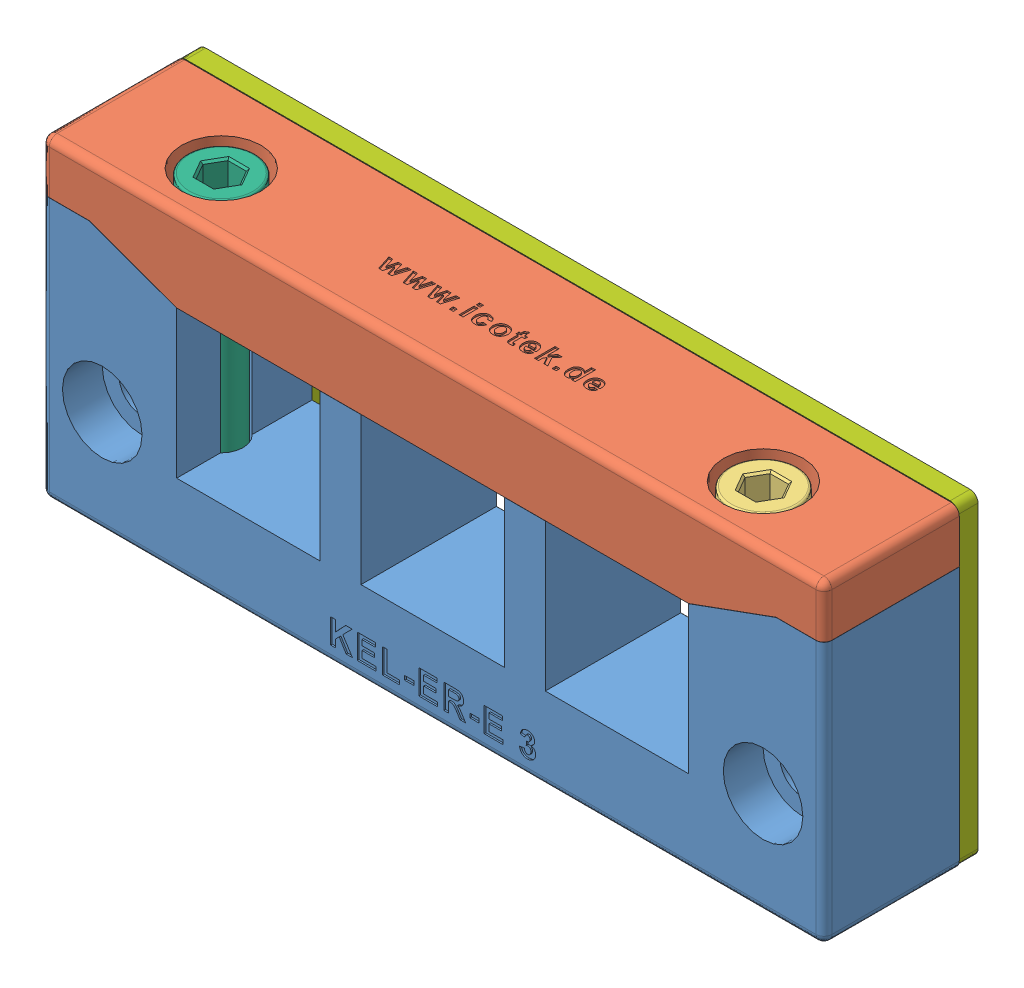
SolidWorks assembly 48258.SLDASM, configuration Default (file format 8000). Lengths in mm.
Overall size (98.3 39.6 19.5).
7 component instances, 7 part files, 0 mates.
Components (placement in the parent):
- 48258_01-1: 48258_01.SLDPRT [Default] at origin size (98.3 32.98 17)
- 48258_02-1: 48258_02.SLDPRT [Default] at origin size (98.3 10.5 17)
- 48258_03-1: 48258_03.SLDPRT [Default] at origin size (8.5 35 8.5)
- 48258_04-1: 48258_04.SLDPRT [Default] at origin size (9.25 4.7 8.01)
- 48258_05-1: 48258_05.SLDPRT [Default] at origin size (9.25 4.7 8.01)
- 48258_06-1: 48258_06.SLDPRT [Default] at origin size (8.5 35 8.5)
- 48258_07-1: 48258_07.SLDPRT [Default] at origin size (98 39.6 2.5)
